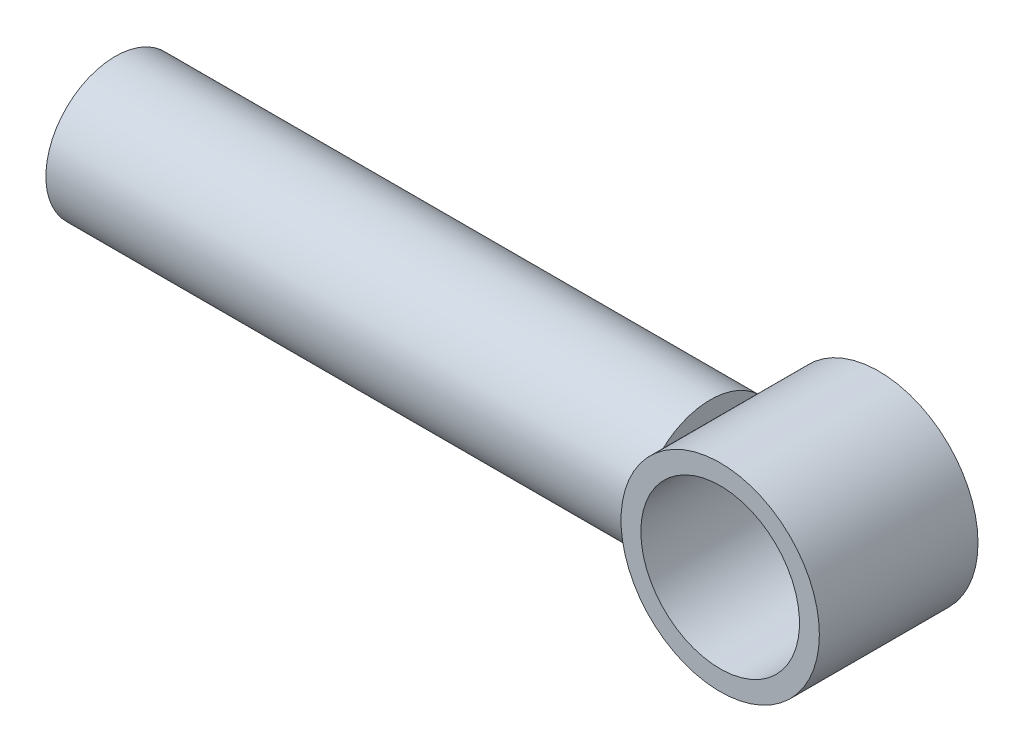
from build123d import *

# Parameters (mm, degrees)
BASE_EXTRUDE_DEPTH      = 50.8
BASE_EXTRUDE_DEPTH_BACK = 50.8
SKETCH1_R               = 63.5
SKETCH1_R_2             = 50.8
SKETCH2_R               = 44.45
BOSS_EXTRUDE2_DEPTH     = 381


with BuildPart() as part:
    # Sketch1 → Base-Extrude (new, two sides: drawn at the far end of the back side and taken through both)
    with BuildSketch(Plane.XY.offset(-BASE_EXTRUDE_DEPTH_BACK)):
        Circle(SKETCH1_R)
        with Locations(Location((0, 0, 0), (0, 0, 180))):
            Circle(SKETCH1_R_2, mode=Mode.SUBTRACT)
    extrude(amount=BASE_EXTRUDE_DEPTH + BASE_EXTRUDE_DEPTH_BACK)

    # Sketch2 → Boss-Extrude2 (add)
    with BuildSketch(Plane(origin=(-57.15, 0, 0), x_dir=(0, 0, -1), z_dir=(1, 0, 0))):
        Circle(SKETCH2_R)
    extrude(amount=-BOSS_EXTRUDE2_DEPTH)


solid = part.part
